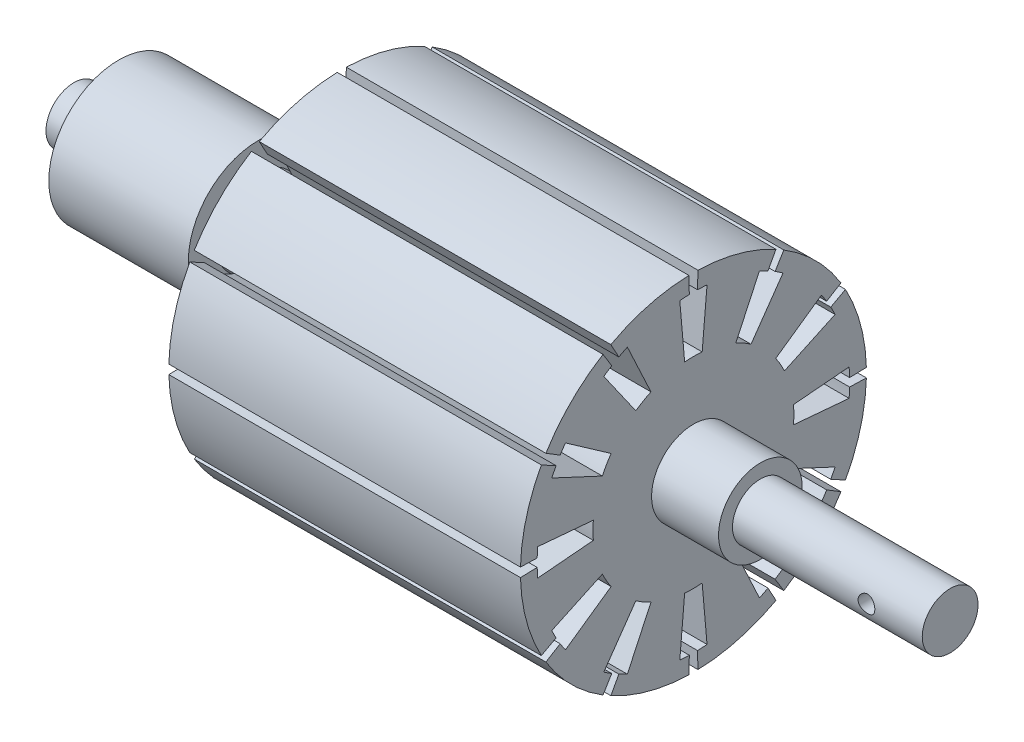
from build123d import *

# Parameters (mm, degrees)
ENL_V_MAT_EXTRU_1_DEPTH = 64.998441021
ESQUISSE3_R             = 1.5
ENL_V_MAT_EXTRU_2_DEPTH = 5


with BuildPart() as part:
    # Esquisse1 → Base-R_volution (revolve)
    with BuildSketch(Plane.XY, mode=Mode.PRIVATE) as base_r_volution_sk:
        Polygon((-48, 0), (-48, 5), (-40, 5), (-40, 12.5), (-15, 12.5), (-15, 7.5), (0, 7.5), (0, 31), (63, 31), (63, 7.5), (75, 7.5), (75, 5), (109, 5), (109, 0), align=None)
    revolve(base_r_volution_sk.sketch.rotate(Axis((-48, 0, 0), (1, 0, 0)), 90), axis=Axis((-48, 0, 0), (1, 0, 0)))

    # Esquisse2 → Enl_v. mat.-Extru.1 (cut)
    with BuildSketch(Plane(origin=(63, 0, 0), x_dir=(0, 0, -1), z_dir=(1, 0, 0))):
        with BuildLine():
            Line((-1.568803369, 17.931504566), (-2.440360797, 27.893451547))
            ThreePointArc((-2.440360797, 27.893451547), (-1.587398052, 27.954966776), (-0.732954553, 27.990405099))
            Line((-0.732954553, 27.990405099), (-0.841696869, 32.143106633))
            ThreePointArc((-0.841696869, 32.143106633), (0, 32.154125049), (0.841696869, 32.143106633))
            Line((0.841696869, 32.143106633), (0.732954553, 27.990405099))
            ThreePointArc((0.732954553, 27.990405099), (1.587398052, 27.954966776), (2.440360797, 27.893451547))
            Line((2.440360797, 27.893451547), (1.568803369, 17.931504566))
            ThreePointArc((1.568803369, 17.931504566), (0, 18), (-1.568803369, 17.931504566))
        make_face()
        with BuildLine():
            Line((13.360445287, 24.606879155), (15.342622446, 28.257595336))
            ThreePointArc((15.342622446, 28.257595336), (16.077062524, 27.846289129), (16.800484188, 27.415898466))
            Line((16.800484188, 27.415898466), (14.629959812, 23.873924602))
            ThreePointArc((14.629959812, 23.873924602), (15.352210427, 23.416012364), (16.060140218, 22.93625724))
            Line((16.060140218, 22.93625724), (10.324375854, 14.744736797))
            ThreePointArc((10.324375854, 14.744736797), (9, 15.588457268), (7.607128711, 16.313540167))
            Line((7.607128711, 16.313540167), (11.833311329, 25.376618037))
            ThreePointArc((11.833311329, 25.376618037), (12.602756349, 25.003410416), (13.360445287, 24.606879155))
        make_face()
        with BuildLine():
            Line((23.873924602, 14.629959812), (27.415898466, 16.800484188))
            ThreePointArc((27.415898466, 16.800484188), (27.846289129, 16.077062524), (28.257595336, 15.342622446))
            Line((28.257595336, 15.342622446), (24.606879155, 13.360445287))
            ThreePointArc((24.606879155, 13.360445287), (25.003410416, 12.602756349), (25.376618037, 11.833311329))
            Line((25.376618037, 11.833311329), (16.313540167, 7.607128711))
            ThreePointArc((16.313540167, 7.607128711), (15.588457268, 9), (14.744736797, 10.324375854))
            Line((14.744736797, 10.324375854), (22.93625724, 16.060140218))
            ThreePointArc((22.93625724, 16.060140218), (23.416012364, 15.352210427), (23.873924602, 14.629959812))
        make_face()
        with BuildLine():
            Line((27.990405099, 0.732954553), (32.143106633, 0.841696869))
            ThreePointArc((32.143106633, 0.841696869), (32.154125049, 0), (32.143106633, -0.841696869))
            Line((32.143106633, -0.841696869), (27.990405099, -0.732954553))
            ThreePointArc((27.990405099, -0.732954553), (27.954966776, -1.587398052), (27.893451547, -2.440360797))
            Line((27.893451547, -2.440360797), (17.931504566, -1.568803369))
            ThreePointArc((17.931504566, -1.568803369), (18, 0), (17.931504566, 1.568803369))
            Line((17.931504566, 1.568803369), (27.893451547, 2.440360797))
            ThreePointArc((27.893451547, 2.440360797), (27.954966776, 1.587398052), (27.990405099, 0.732954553))
        make_face()
        with BuildLine():
            Line((24.606879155, -13.360445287), (28.257595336, -15.342622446))
            ThreePointArc((28.257595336, -15.342622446), (27.846289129, -16.077062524), (27.415898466, -16.800484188))
            Line((27.415898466, -16.800484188), (23.873924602, -14.629959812))
            ThreePointArc((23.873924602, -14.629959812), (23.416012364, -15.352210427), (22.93625724, -16.060140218))
            Line((22.93625724, -16.060140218), (14.744736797, -10.324375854))
            ThreePointArc((14.744736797, -10.324375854), (15.588457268, -9), (16.313540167, -7.607128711))
            Line((16.313540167, -7.607128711), (25.376618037, -11.833311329))
            ThreePointArc((25.376618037, -11.833311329), (25.003410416, -12.602756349), (24.606879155, -13.360445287))
        make_face()
        with BuildLine():
            Line((14.629959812, -23.873924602), (16.800484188, -27.415898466))
            ThreePointArc((16.800484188, -27.415898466), (16.077062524, -27.846289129), (15.342622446, -28.257595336))
            Line((15.342622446, -28.257595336), (13.360445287, -24.606879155))
            ThreePointArc((13.360445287, -24.606879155), (12.602756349, -25.003410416), (11.833311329, -25.376618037))
            Line((11.833311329, -25.376618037), (7.607128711, -16.313540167))
            ThreePointArc((7.607128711, -16.313540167), (9, -15.588457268), (10.324375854, -14.744736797))
            Line((10.324375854, -14.744736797), (16.060140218, -22.93625724))
            ThreePointArc((16.060140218, -22.93625724), (15.352210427, -23.416012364), (14.629959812, -23.873924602))
        make_face()
        with BuildLine():
            Line((0.732954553, -27.990405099), (0.841696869, -32.143106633))
            ThreePointArc((0.841696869, -32.143106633), (0, -32.154125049), (-0.841696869, -32.143106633))
            Line((-0.841696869, -32.143106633), (-0.732954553, -27.990405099))
            ThreePointArc((-0.732954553, -27.990405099), (-1.587398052, -27.954966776), (-2.440360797, -27.893451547))
            Line((-2.440360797, -27.893451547), (-1.568803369, -17.931504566))
            ThreePointArc((-1.568803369, -17.931504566), (0, -18), (1.568803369, -17.931504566))
            Line((1.568803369, -17.931504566), (2.440360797, -27.893451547))
            ThreePointArc((2.440360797, -27.893451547), (1.587398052, -27.954966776), (0.732954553, -27.990405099))
        make_face()
        with BuildLine():
            Line((-13.360445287, -24.606879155), (-15.342622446, -28.257595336))
            ThreePointArc((-15.342622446, -28.257595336), (-16.077062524, -27.846289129), (-16.800484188, -27.415898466))
            Line((-16.800484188, -27.415898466), (-14.629959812, -23.873924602))
            ThreePointArc((-14.629959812, -23.873924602), (-15.352210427, -23.416012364), (-16.060140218, -22.93625724))
            Line((-16.060140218, -22.93625724), (-10.324375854, -14.744736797))
            ThreePointArc((-10.324375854, -14.744736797), (-9, -15.588457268), (-7.607128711, -16.313540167))
            Line((-7.607128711, -16.313540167), (-11.833311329, -25.376618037))
            ThreePointArc((-11.833311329, -25.376618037), (-12.602756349, -25.003410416), (-13.360445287, -24.606879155))
        make_face()
        with BuildLine():
            Line((-23.873924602, -14.629959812), (-27.415898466, -16.800484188))
            ThreePointArc((-27.415898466, -16.800484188), (-27.846289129, -16.077062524), (-28.257595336, -15.342622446))
            Line((-28.257595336, -15.342622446), (-24.606879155, -13.360445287))
            ThreePointArc((-24.606879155, -13.360445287), (-25.003410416, -12.602756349), (-25.376618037, -11.833311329))
            Line((-25.376618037, -11.833311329), (-16.313540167, -7.607128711))
            ThreePointArc((-16.313540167, -7.607128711), (-15.588457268, -9), (-14.744736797, -10.324375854))
            Line((-14.744736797, -10.324375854), (-22.93625724, -16.060140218))
            ThreePointArc((-22.93625724, -16.060140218), (-23.416012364, -15.352210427), (-23.873924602, -14.629959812))
        make_face()
        with BuildLine():
            Line((-27.990405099, -0.732954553), (-32.143106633, -0.841696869))
            ThreePointArc((-32.143106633, -0.841696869), (-32.154125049, 0), (-32.143106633, 0.841696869))
            Line((-32.143106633, 0.841696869), (-27.990405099, 0.732954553))
            ThreePointArc((-27.990405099, 0.732954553), (-27.954966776, 1.587398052), (-27.893451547, 2.440360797))
            Line((-27.893451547, 2.440360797), (-17.931504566, 1.568803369))
            ThreePointArc((-17.931504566, 1.568803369), (-18, 0), (-17.931504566, -1.568803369))
            Line((-17.931504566, -1.568803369), (-27.893451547, -2.440360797))
            ThreePointArc((-27.893451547, -2.440360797), (-27.954966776, -1.587398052), (-27.990405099, -0.732954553))
        make_face()
        with BuildLine():
            Line((-24.606879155, 13.360445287), (-28.257595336, 15.342622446))
            ThreePointArc((-28.257595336, 15.342622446), (-27.846289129, 16.077062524), (-27.415898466, 16.800484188))
            Line((-27.415898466, 16.800484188), (-23.873924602, 14.629959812))
            ThreePointArc((-23.873924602, 14.629959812), (-23.416012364, 15.352210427), (-22.93625724, 16.060140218))
            Line((-22.93625724, 16.060140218), (-14.744736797, 10.324375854))
            ThreePointArc((-14.744736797, 10.324375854), (-15.588457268, 9), (-16.313540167, 7.607128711))
            Line((-16.313540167, 7.607128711), (-25.376618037, 11.833311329))
            ThreePointArc((-25.376618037, 11.833311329), (-25.003410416, 12.602756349), (-24.606879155, 13.360445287))
        make_face()
        with BuildLine():
            Line((-14.629959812, 23.873924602), (-16.800484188, 27.415898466))
            ThreePointArc((-16.800484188, 27.415898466), (-16.077062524, 27.846289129), (-15.342622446, 28.257595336))
            Line((-15.342622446, 28.257595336), (-13.360445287, 24.606879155))
            ThreePointArc((-13.360445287, 24.606879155), (-12.602756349, 25.003410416), (-11.833311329, 25.376618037))
            Line((-11.833311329, 25.376618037), (-7.607128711, 16.313540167))
            ThreePointArc((-7.607128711, 16.313540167), (-9, 15.588457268), (-10.324375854, 14.744736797))
            Line((-10.324375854, 14.744736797), (-16.060140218, 22.93625724))
            ThreePointArc((-16.060140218, 22.93625724), (-15.352210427, 23.416012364), (-14.629959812, 23.873924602))
        make_face()
    extrude(amount=-ENL_V_MAT_EXTRU_1_DEPTH, mode=Mode.SUBTRACT)

    # Esquisse3 → Enl_v. mat.-Extru.2 (cut, symmetric)
    with BuildSketch(Plane.XY):
        with Locations((99, 0)):
            Circle(ESQUISSE3_R)
    extrude(amount=ENL_V_MAT_EXTRU_2_DEPTH, both=True, mode=Mode.SUBTRACT)


solid = part.part
